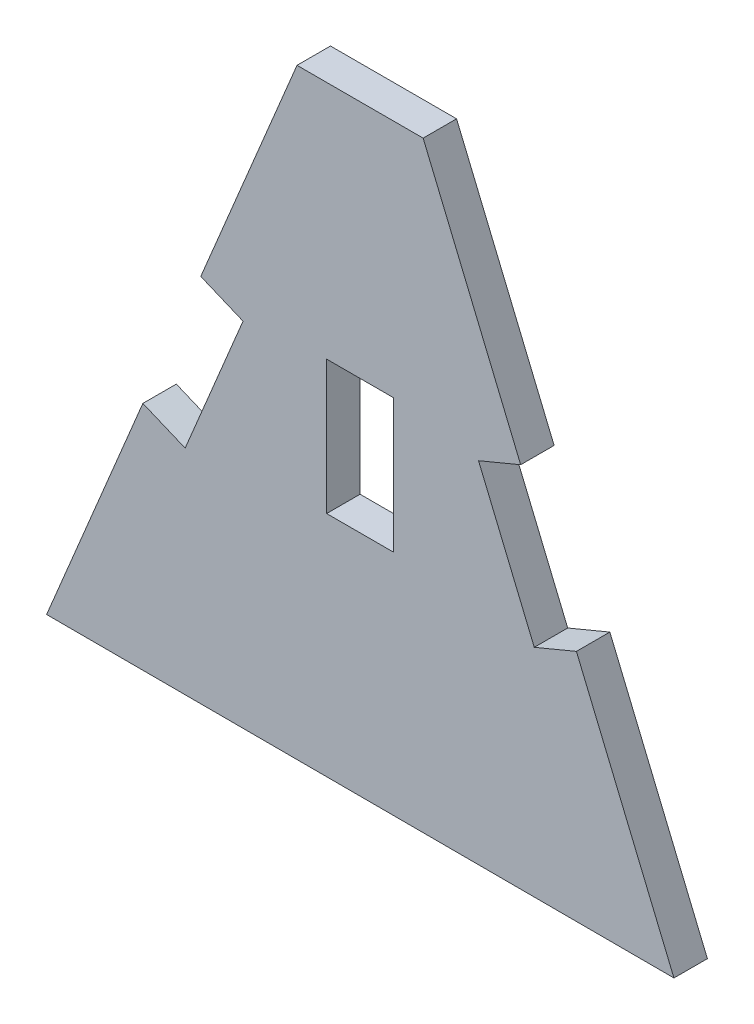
ISO-10303-21;
HEADER;
FILE_DESCRIPTION(('STEP AP214'),'2;1');
FILE_NAME('part.step','',(''),(''),'','','');
FILE_SCHEMA(('AUTOMOTIVE_DESIGN { 1 0 10303 214 1 1 1 1 }'));
ENDSEC;
DATA;
#1=APPLICATION_CONTEXT('core data for automotive mechanical design processes');
#2=APPLICATION_PROTOCOL_DEFINITION('international standard','automotive_design',2000,#1);
#3=PRODUCT_CONTEXT('',#1,'mechanical');
#4=PRODUCT('Part','Part','',(#3));
#5=PRODUCT_RELATED_PRODUCT_CATEGORY('part','',(#4));
#6=PRODUCT_DEFINITION_FORMATION('','',#4);
#7=PRODUCT_DEFINITION_CONTEXT('part definition',#1,'design');
#8=PRODUCT_DEFINITION('design','',#6,#7);
#9=PRODUCT_DEFINITION_SHAPE('','',#8);
#10=(LENGTH_UNIT() NAMED_UNIT(*) SI_UNIT(.MILLI.,.METRE.));
#11=(NAMED_UNIT(*) PLANE_ANGLE_UNIT() SI_UNIT($,.RADIAN.));
#12=(NAMED_UNIT(*) SI_UNIT($,.STERADIAN.) SOLID_ANGLE_UNIT());
#13=UNCERTAINTY_MEASURE_WITH_UNIT(LENGTH_MEASURE(1.E-05),#10,'distance_accuracy_value','');
#14=(GEOMETRIC_REPRESENTATION_CONTEXT(3) GLOBAL_UNCERTAINTY_ASSIGNED_CONTEXT((#13)) GLOBAL_UNIT_ASSIGNED_CONTEXT((#10,
#11,#12)) REPRESENTATION_CONTEXT('',''));
#15=CARTESIAN_POINT('',(0.,0.,0.));
#16=DIRECTION('',(0.,0.,1.));
#17=DIRECTION('',(1.,0.,0.));
#18=AXIS2_PLACEMENT_3D('',#15,#16,#17);
#19=CARTESIAN_POINT('',(0.,0.,1.524));
#20=DIRECTION('',(0.,0.,-1.));
#21=DIRECTION('',(-1.,0.,0.));
#22=AXIS2_PLACEMENT_3D('',#19,#20,#21);
#23=PLANE('',#22);
#24=DIRECTION('',(0.999998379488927,-0.00180028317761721,0.));
#25=VECTOR('',#24,1.);
#26=CARTESIAN_POINT('',(14.2962974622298,-13.7179386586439,1.524));
#27=LINE('',#26,#25);
#28=CARTESIAN_POINT('',(-14.2962974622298,-13.6664638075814,1.524));
#29=VERTEX_POINT('',#28);
#30=CARTESIAN_POINT('',(14.2962974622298,-13.7179386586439,1.524));
#31=VERTEX_POINT('',#30);
#32=EDGE_CURVE('E183',#29,#31,#27,.T.);
#33=ORIENTED_EDGE('',*,*,#32,.T.);
#34=DIRECTION('',(-0.384618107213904,0.923075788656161,0.));
#35=VECTOR('',#34,1.);
#36=CARTESIAN_POINT('',(9.85045119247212,-3.04799625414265,1.524));
#37=LINE('',#36,#35);
#38=CARTESIAN_POINT('',(9.85045119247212,-3.04799625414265,1.524));
#39=VERTEX_POINT('',#38);
#40=EDGE_CURVE('E186',#31,#39,#37,.T.);
#41=ORIENTED_EDGE('',*,*,#40,.T.);
#42=DIRECTION('',(-0.923075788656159,-0.38461810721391,0.));
#43=VECTOR('',#42,1.);
#44=CARTESIAN_POINT('',(9.85045119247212,-3.04799625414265,1.524));
#45=LINE('',#44,#43);
#46=CARTESIAN_POINT('',(7.92983666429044,-3.84825895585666,1.524));
#47=VERTEX_POINT('',#46);
#48=EDGE_CURVE('E189',#39,#47,#45,.T.);
#49=ORIENTED_EDGE('',*,*,#48,.T.);
#50=DIRECTION('',(-0.384618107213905,0.923075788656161,0.));
#51=VECTOR('',#50,1.);
#52=CARTESIAN_POINT('',(5.38981868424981,2.24773355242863,1.524));
#53=LINE('',#52,#51);
#54=CARTESIAN_POINT('',(5.38981868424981,2.24773355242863,1.524));
#55=VERTEX_POINT('',#54);
#56=EDGE_CURVE('E191',#47,#55,#53,.T.);
#57=ORIENTED_EDGE('',*,*,#56,.T.);
#58=DIRECTION('',(0.923075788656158,0.384618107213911,0.));
#59=VECTOR('',#58,1.);
#60=CARTESIAN_POINT('',(7.31043321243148,3.04799625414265,1.524));
#61=LINE('',#60,#59);
#62=CARTESIAN_POINT('',(7.31043321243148,3.04799625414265,1.524));
#63=VERTEX_POINT('',#62);
#64=EDGE_CURVE('E193',#55,#63,#61,.T.);
#65=ORIENTED_EDGE('',*,*,#64,.T.);
#66=DIRECTION('',(-0.384618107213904,0.923075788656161,0.));
#67=VECTOR('',#66,1.);
#68=CARTESIAN_POINT('',(2.86458694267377,13.7179386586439,1.524));
#69=LINE('',#68,#67);
#70=CARTESIAN_POINT('',(2.86458694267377,13.7179386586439,1.524));
#71=VERTEX_POINT('',#70);
#72=EDGE_CURVE('E195',#63,#71,#69,.T.);
#73=ORIENTED_EDGE('',*,*,#72,.T.);
#74=DIRECTION('',(-1.,0.,0.));
#75=VECTOR('',#74,1.);
#76=CARTESIAN_POINT('',(-2.88302096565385,13.7179386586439,1.524));
#77=LINE('',#76,#75);
#78=CARTESIAN_POINT('',(-2.88302096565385,13.7179386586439,1.524));
#79=VERTEX_POINT('',#78);
#80=EDGE_CURVE('E197',#71,#79,#77,.T.);
#81=ORIENTED_EDGE('',*,*,#80,.T.);
#82=DIRECTION('',(-0.384704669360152,-0.923039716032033,0.));
#83=VECTOR('',#82,1.);
#84=CARTESIAN_POINT('',(-7.27050690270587,3.19084061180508,1.524));
#85=LINE('',#84,#83);
#86=CARTESIAN_POINT('',(-7.27050690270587,3.19084061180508,1.524));
#87=VERTEX_POINT('',#86);
#88=EDGE_CURVE('E199',#79,#87,#85,.T.);
#89=ORIENTED_EDGE('',*,*,#88,.T.);
#90=DIRECTION('',(0.923039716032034,-0.384704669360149,0.));
#91=VECTOR('',#90,1.);
#92=CARTESIAN_POINT('',(-7.27050690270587,3.19084061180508,1.524));
#93=LINE('',#92,#91);
#94=CARTESIAN_POINT('',(-5.34386507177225,2.38785446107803,1.524));
#95=VERTEX_POINT('',#94);
#96=EDGE_CURVE('E201',#87,#95,#93,.T.);
#97=ORIENTED_EDGE('',*,*,#96,.T.);
#98=DIRECTION('',(-0.384704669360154,-0.923039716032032,0.));
#99=VECTOR('',#98,1.);
#100=CARTESIAN_POINT('',(-7.98216969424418,-3.94235191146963,1.524));
#101=LINE('',#100,#99);
#102=CARTESIAN_POINT('',(-7.98216969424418,-3.94235191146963,1.524));
#103=VERTEX_POINT('',#102);
#104=EDGE_CURVE('E203',#95,#103,#101,.T.);
#105=ORIENTED_EDGE('',*,*,#104,.T.);
#106=DIRECTION('',(-0.923039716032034,0.384704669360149,0.));
#107=VECTOR('',#106,1.);
#108=CARTESIAN_POINT('',(-9.9088115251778,-3.13936576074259,1.524));
#109=LINE('',#108,#107);
#110=CARTESIAN_POINT('',(-9.9088115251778,-3.13936576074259,1.524));
#111=VERTEX_POINT('',#110);
#112=EDGE_CURVE('E205',#103,#111,#109,.T.);
#113=ORIENTED_EDGE('',*,*,#112,.T.);
#114=DIRECTION('',(-0.384704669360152,-0.923039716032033,0.));
#115=VECTOR('',#114,1.);
#116=CARTESIAN_POINT('',(-14.2962974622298,-13.6664638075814,1.524));
#117=LINE('',#116,#115);
#118=EDGE_CURVE('E207',#111,#29,#117,.T.);
#119=ORIENTED_EDGE('',*,*,#118,.T.);
#120=EDGE_LOOP('',(#33,#41,#49,#57,#65,#73,#81,#89,#97,#105,#113,#119));
#121=FACE_BOUND('',#120,.T.);
#122=DIRECTION('',(-1.,0.,0.));
#123=VECTOR('',#122,1.);
#124=CARTESIAN_POINT('',(-1.53321701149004,2.79593865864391,1.524));
#125=LINE('',#124,#123);
#126=CARTESIAN_POINT('',(1.51478298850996,2.79593865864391,1.524));
#127=VERTEX_POINT('',#126);
#128=CARTESIAN_POINT('',(-1.53321701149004,2.79593865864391,1.524));
#129=VERTEX_POINT('',#128);
#130=EDGE_CURVE('E147',#127,#129,#125,.T.);
#131=ORIENTED_EDGE('',*,*,#130,.F.);
#132=DIRECTION('',(0.,1.,0.));
#133=VECTOR('',#132,1.);
#134=CARTESIAN_POINT('',(1.51478298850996,2.79593865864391,1.524));
#135=LINE('',#134,#133);
#136=CARTESIAN_POINT('',(1.51478298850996,-3.30006134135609,1.524));
#137=VERTEX_POINT('',#136);
#138=EDGE_CURVE('E169',#137,#127,#135,.T.);
#139=ORIENTED_EDGE('',*,*,#138,.F.);
#140=DIRECTION('',(1.,0.,0.));
#141=VECTOR('',#140,1.);
#142=CARTESIAN_POINT('',(-1.53321701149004,-3.30006134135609,1.524));
#143=LINE('',#142,#141);
#144=CARTESIAN_POINT('',(-1.53321701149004,-3.30006134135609,1.524));
#145=VERTEX_POINT('',#144);
#146=EDGE_CURVE('E167',#145,#137,#143,.T.);
#147=ORIENTED_EDGE('',*,*,#146,.F.);
#148=DIRECTION('',(0.,-1.,0.));
#149=VECTOR('',#148,1.);
#150=CARTESIAN_POINT('',(-1.53321701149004,2.79593865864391,1.524));
#151=LINE('',#150,#149);
#152=EDGE_CURVE('E155',#129,#145,#151,.T.);
#153=ORIENTED_EDGE('',*,*,#152,.F.);
#154=EDGE_LOOP('',(#131,#139,#147,#153));
#155=FACE_BOUND('',#154,.T.);
#156=ADVANCED_FACE('F34',(#121,#155),#23,.F.);
#157=CARTESIAN_POINT('',(0.,0.,0.));
#158=DIRECTION('',(0.,0.,-1.));
#159=DIRECTION('',(-1.,0.,0.));
#160=AXIS2_PLACEMENT_3D('',#157,#158,#159);
#161=PLANE('',#160);
#162=DIRECTION('',(0.999998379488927,-0.00180028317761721,0.));
#163=VECTOR('',#162,1.);
#164=CARTESIAN_POINT('',(14.2962974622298,-13.7179386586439,0.));
#165=LINE('',#164,#163);
#166=CARTESIAN_POINT('',(-14.2962974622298,-13.6664638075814,0.));
#167=VERTEX_POINT('',#166);
#168=CARTESIAN_POINT('',(14.2962974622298,-13.7179386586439,0.));
#169=VERTEX_POINT('',#168);
#170=EDGE_CURVE('E163',#167,#169,#165,.T.);
#171=ORIENTED_EDGE('',*,*,#170,.F.);
#172=DIRECTION('',(-0.384704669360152,-0.923039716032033,0.));
#173=VECTOR('',#172,1.);
#174=CARTESIAN_POINT('',(-14.2962974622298,-13.6664638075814,0.));
#175=LINE('',#174,#173);
#176=CARTESIAN_POINT('',(-9.9088115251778,-3.13936576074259,0.));
#177=VERTEX_POINT('',#176);
#178=EDGE_CURVE('E187',#177,#167,#175,.T.);
#179=ORIENTED_EDGE('',*,*,#178,.F.);
#180=DIRECTION('',(-0.923039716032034,0.384704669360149,0.));
#181=VECTOR('',#180,1.);
#182=CARTESIAN_POINT('',(-9.9088115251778,-3.13936576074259,0.));
#183=LINE('',#182,#181);
#184=CARTESIAN_POINT('',(-7.98216969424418,-3.94235191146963,0.));
#185=VERTEX_POINT('',#184);
#186=EDGE_CURVE('E230',#185,#177,#183,.T.);
#187=ORIENTED_EDGE('',*,*,#186,.F.);
#188=DIRECTION('',(-0.384704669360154,-0.923039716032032,0.));
#189=VECTOR('',#188,1.);
#190=CARTESIAN_POINT('',(-7.98216969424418,-3.94235191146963,0.));
#191=LINE('',#190,#189);
#192=CARTESIAN_POINT('',(-5.34386507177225,2.38785446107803,0.));
#193=VERTEX_POINT('',#192);
#194=EDGE_CURVE('E228',#193,#185,#191,.T.);
#195=ORIENTED_EDGE('',*,*,#194,.F.);
#196=DIRECTION('',(0.923039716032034,-0.384704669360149,0.));
#197=VECTOR('',#196,1.);
#198=CARTESIAN_POINT('',(-7.27050690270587,3.19084061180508,0.));
#199=LINE('',#198,#197);
#200=CARTESIAN_POINT('',(-7.27050690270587,3.19084061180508,0.));
#201=VERTEX_POINT('',#200);
#202=EDGE_CURVE('E226',#201,#193,#199,.T.);
#203=ORIENTED_EDGE('',*,*,#202,.F.);
#204=DIRECTION('',(-0.384704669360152,-0.923039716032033,0.));
#205=VECTOR('',#204,1.);
#206=CARTESIAN_POINT('',(-7.27050690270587,3.19084061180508,0.));
#207=LINE('',#206,#205);
#208=CARTESIAN_POINT('',(-2.88302096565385,13.7179386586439,0.));
#209=VERTEX_POINT('',#208);
#210=EDGE_CURVE('E224',#209,#201,#207,.T.);
#211=ORIENTED_EDGE('',*,*,#210,.F.);
#212=DIRECTION('',(-1.,0.,0.));
#213=VECTOR('',#212,1.);
#214=CARTESIAN_POINT('',(-2.88302096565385,13.7179386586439,0.));
#215=LINE('',#214,#213);
#216=CARTESIAN_POINT('',(2.86458694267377,13.7179386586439,0.));
#217=VERTEX_POINT('',#216);
#218=EDGE_CURVE('E222',#217,#209,#215,.T.);
#219=ORIENTED_EDGE('',*,*,#218,.F.);
#220=DIRECTION('',(-0.384618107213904,0.923075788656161,0.));
#221=VECTOR('',#220,1.);
#222=CARTESIAN_POINT('',(2.86458694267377,13.7179386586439,0.));
#223=LINE('',#222,#221);
#224=CARTESIAN_POINT('',(7.31043321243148,3.04799625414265,0.));
#225=VERTEX_POINT('',#224);
#226=EDGE_CURVE('E220',#225,#217,#223,.T.);
#227=ORIENTED_EDGE('',*,*,#226,.F.);
#228=DIRECTION('',(0.923075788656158,0.384618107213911,0.));
#229=VECTOR('',#228,1.);
#230=CARTESIAN_POINT('',(7.31043321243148,3.04799625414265,0.));
#231=LINE('',#230,#229);
#232=CARTESIAN_POINT('',(5.38981868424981,2.24773355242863,0.));
#233=VERTEX_POINT('',#232);
#234=EDGE_CURVE('E218',#233,#225,#231,.T.);
#235=ORIENTED_EDGE('',*,*,#234,.F.);
#236=DIRECTION('',(-0.384618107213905,0.923075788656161,0.));
#237=VECTOR('',#236,1.);
#238=CARTESIAN_POINT('',(5.38981868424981,2.24773355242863,0.));
#239=LINE('',#238,#237);
#240=CARTESIAN_POINT('',(7.92983666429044,-3.84825895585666,0.));
#241=VERTEX_POINT('',#240);
#242=EDGE_CURVE('E216',#241,#233,#239,.T.);
#243=ORIENTED_EDGE('',*,*,#242,.F.);
#244=DIRECTION('',(-0.923075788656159,-0.38461810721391,0.));
#245=VECTOR('',#244,1.);
#246=CARTESIAN_POINT('',(9.85045119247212,-3.04799625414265,0.));
#247=LINE('',#246,#245);
#248=CARTESIAN_POINT('',(9.85045119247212,-3.04799625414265,0.));
#249=VERTEX_POINT('',#248);
#250=EDGE_CURVE('E214',#249,#241,#247,.T.);
#251=ORIENTED_EDGE('',*,*,#250,.F.);
#252=DIRECTION('',(-0.384618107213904,0.923075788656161,0.));
#253=VECTOR('',#252,1.);
#254=CARTESIAN_POINT('',(9.85045119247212,-3.04799625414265,0.));
#255=LINE('',#254,#253);
#256=EDGE_CURVE('E212',#169,#249,#255,.T.);
#257=ORIENTED_EDGE('',*,*,#256,.F.);
#258=EDGE_LOOP('',(#171,#179,#187,#195,#203,#211,#219,#227,#235,#243,#251,#257));
#259=FACE_BOUND('',#258,.T.);
#260=DIRECTION('',(0.,1.,0.));
#261=VECTOR('',#260,1.);
#262=CARTESIAN_POINT('',(1.51478298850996,2.79593865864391,0.));
#263=LINE('',#262,#261);
#264=CARTESIAN_POINT('',(1.51478298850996,-3.30006134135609,0.));
#265=VERTEX_POINT('',#264);
#266=CARTESIAN_POINT('',(1.51478298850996,2.79593865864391,0.));
#267=VERTEX_POINT('',#266);
#268=EDGE_CURVE('E156',#265,#267,#263,.T.);
#269=ORIENTED_EDGE('',*,*,#268,.T.);
#270=DIRECTION('',(-1.,0.,0.));
#271=VECTOR('',#270,1.);
#272=CARTESIAN_POINT('',(-1.53321701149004,2.79593865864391,0.));
#273=LINE('',#272,#271);
#274=CARTESIAN_POINT('',(-1.53321701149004,2.79593865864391,0.));
#275=VERTEX_POINT('',#274);
#276=EDGE_CURVE('E57',#267,#275,#273,.T.);
#277=ORIENTED_EDGE('',*,*,#276,.T.);
#278=DIRECTION('',(0.,-1.,0.));
#279=VECTOR('',#278,1.);
#280=CARTESIAN_POINT('',(-1.53321701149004,2.79593865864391,0.));
#281=LINE('',#280,#279);
#282=CARTESIAN_POINT('',(-1.53321701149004,-3.30006134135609,0.));
#283=VERTEX_POINT('',#282);
#284=EDGE_CURVE('E162',#275,#283,#281,.T.);
#285=ORIENTED_EDGE('',*,*,#284,.T.);
#286=DIRECTION('',(1.,0.,0.));
#287=VECTOR('',#286,1.);
#288=CARTESIAN_POINT('',(-1.53321701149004,-3.30006134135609,0.));
#289=LINE('',#288,#287);
#290=EDGE_CURVE('E175',#283,#265,#289,.T.);
#291=ORIENTED_EDGE('',*,*,#290,.T.);
#292=EDGE_LOOP('',(#269,#277,#285,#291));
#293=FACE_BOUND('',#292,.T.);
#294=ADVANCED_FACE('F272',(#259,#293),#161,.T.);
#295=CARTESIAN_POINT('',(14.2962974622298,-13.7179386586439,1.524));
#296=DIRECTION('',(0.00180028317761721,0.999998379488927,0.));
#297=DIRECTION('',(-0.999998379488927,0.00180028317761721,0.));
#298=AXIS2_PLACEMENT_3D('',#295,#296,#297);
#299=PLANE('',#298);
#300=ORIENTED_EDGE('',*,*,#170,.T.);
#301=DIRECTION('',(0.,0.,-1.));
#302=VECTOR('',#301,1.);
#303=CARTESIAN_POINT('',(14.2962974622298,-13.7179386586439,1.524));
#304=LINE('',#303,#302);
#305=EDGE_CURVE('E11',#31,#169,#304,.T.);
#306=ORIENTED_EDGE('',*,*,#305,.F.);
#307=ORIENTED_EDGE('',*,*,#32,.F.);
#308=DIRECTION('',(0.,0.,-1.));
#309=VECTOR('',#308,1.);
#310=CARTESIAN_POINT('',(-14.2962974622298,-13.6664638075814,1.524));
#311=LINE('',#310,#309);
#312=EDGE_CURVE('E209',#29,#167,#311,.T.);
#313=ORIENTED_EDGE('',*,*,#312,.T.);
#314=EDGE_LOOP('',(#300,#306,#307,#313));
#315=FACE_BOUND('',#314,.T.);
#316=ADVANCED_FACE('F36',(#315),#299,.F.);
#317=CARTESIAN_POINT('',(9.85045119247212,-3.04799625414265,1.524));
#318=DIRECTION('',(-0.923075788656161,-0.384618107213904,0.));
#319=DIRECTION('',(0.384618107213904,-0.923075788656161,0.));
#320=AXIS2_PLACEMENT_3D('',#317,#318,#319);
#321=PLANE('',#320);
#322=ORIENTED_EDGE('',*,*,#256,.T.);
#323=DIRECTION('',(0.,0.,-1.));
#324=VECTOR('',#323,1.);
#325=CARTESIAN_POINT('',(9.85045119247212,-3.04799625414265,1.524));
#326=LINE('',#325,#324);
#327=EDGE_CURVE('E42',#39,#249,#326,.T.);
#328=ORIENTED_EDGE('',*,*,#327,.F.);
#329=ORIENTED_EDGE('',*,*,#40,.F.);
#330=ORIENTED_EDGE('',*,*,#305,.T.);
#331=EDGE_LOOP('',(#322,#328,#329,#330));
#332=FACE_BOUND('',#331,.T.);
#333=ADVANCED_FACE('F289',(#332),#321,.F.);
#334=CARTESIAN_POINT('',(9.85045119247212,-3.04799625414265,1.524));
#335=DIRECTION('',(0.38461810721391,-0.923075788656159,0.));
#336=DIRECTION('',(0.923075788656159,0.38461810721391,0.));
#337=AXIS2_PLACEMENT_3D('',#334,#335,#336);
#338=PLANE('',#337);
#339=ORIENTED_EDGE('',*,*,#250,.T.);
#340=DIRECTION('',(0.,0.,-1.));
#341=VECTOR('',#340,1.);
#342=CARTESIAN_POINT('',(7.92983666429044,-3.84825895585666,1.524));
#343=LINE('',#342,#341);
#344=EDGE_CURVE('E259',#47,#241,#343,.T.);
#345=ORIENTED_EDGE('',*,*,#344,.F.);
#346=ORIENTED_EDGE('',*,*,#48,.F.);
#347=ORIENTED_EDGE('',*,*,#327,.T.);
#348=EDGE_LOOP('',(#339,#345,#346,#347));
#349=FACE_BOUND('',#348,.T.);
#350=ADVANCED_FACE('F266',(#349),#338,.F.);
#351=CARTESIAN_POINT('',(5.38981868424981,2.24773355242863,1.524));
#352=DIRECTION('',(-0.923075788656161,-0.384618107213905,0.));
#353=DIRECTION('',(0.384618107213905,-0.923075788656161,0.));
#354=AXIS2_PLACEMENT_3D('',#351,#352,#353);
#355=PLANE('',#354);
#356=ORIENTED_EDGE('',*,*,#242,.T.);
#357=DIRECTION('',(0.,0.,-1.));
#358=VECTOR('',#357,1.);
#359=CARTESIAN_POINT('',(5.38981868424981,2.24773355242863,1.524));
#360=LINE('',#359,#358);
#361=EDGE_CURVE('E256',#55,#233,#360,.T.);
#362=ORIENTED_EDGE('',*,*,#361,.F.);
#363=ORIENTED_EDGE('',*,*,#56,.F.);
#364=ORIENTED_EDGE('',*,*,#344,.T.);
#365=EDGE_LOOP('',(#356,#362,#363,#364));
#366=FACE_BOUND('',#365,.T.);
#367=ADVANCED_FACE('F278',(#366),#355,.F.);
#368=CARTESIAN_POINT('',(7.31043321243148,3.04799625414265,1.524));
#369=DIRECTION('',(-0.384618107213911,0.923075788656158,0.));
#370=DIRECTION('',(-0.923075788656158,-0.384618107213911,0.));
#371=AXIS2_PLACEMENT_3D('',#368,#369,#370);
#372=PLANE('',#371);
#373=ORIENTED_EDGE('',*,*,#234,.T.);
#374=DIRECTION('',(0.,0.,-1.));
#375=VECTOR('',#374,1.);
#376=CARTESIAN_POINT('',(7.31043321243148,3.04799625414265,1.524));
#377=LINE('',#376,#375);
#378=EDGE_CURVE('E253',#63,#225,#377,.T.);
#379=ORIENTED_EDGE('',*,*,#378,.F.);
#380=ORIENTED_EDGE('',*,*,#64,.F.);
#381=ORIENTED_EDGE('',*,*,#361,.T.);
#382=EDGE_LOOP('',(#373,#379,#380,#381));
#383=FACE_BOUND('',#382,.T.);
#384=ADVANCED_FACE('F282',(#383),#372,.F.);
#385=CARTESIAN_POINT('',(2.86458694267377,13.7179386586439,1.524));
#386=DIRECTION('',(-0.923075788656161,-0.384618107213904,0.));
#387=DIRECTION('',(0.384618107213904,-0.923075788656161,0.));
#388=AXIS2_PLACEMENT_3D('',#385,#386,#387);
#389=PLANE('',#388);
#390=ORIENTED_EDGE('',*,*,#226,.T.);
#391=DIRECTION('',(0.,0.,-1.));
#392=VECTOR('',#391,1.);
#393=CARTESIAN_POINT('',(2.86458694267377,13.7179386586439,1.524));
#394=LINE('',#393,#392);
#395=EDGE_CURVE('E250',#71,#217,#394,.T.);
#396=ORIENTED_EDGE('',*,*,#395,.F.);
#397=ORIENTED_EDGE('',*,*,#72,.F.);
#398=ORIENTED_EDGE('',*,*,#378,.T.);
#399=EDGE_LOOP('',(#390,#396,#397,#398));
#400=FACE_BOUND('',#399,.T.);
#401=ADVANCED_FACE('F322',(#400),#389,.F.);
#402=CARTESIAN_POINT('',(-2.88302096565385,13.7179386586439,1.524));
#403=DIRECTION('',(0.,-1.,0.));
#404=DIRECTION('',(0.,0.,-1.));
#405=AXIS2_PLACEMENT_3D('',#402,#403,#404);
#406=PLANE('',#405);
#407=ORIENTED_EDGE('',*,*,#218,.T.);
#408=DIRECTION('',(0.,0.,-1.));
#409=VECTOR('',#408,1.);
#410=CARTESIAN_POINT('',(-2.88302096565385,13.7179386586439,1.524));
#411=LINE('',#410,#409);
#412=EDGE_CURVE('E247',#79,#209,#411,.T.);
#413=ORIENTED_EDGE('',*,*,#412,.F.);
#414=ORIENTED_EDGE('',*,*,#80,.F.);
#415=ORIENTED_EDGE('',*,*,#395,.T.);
#416=EDGE_LOOP('',(#407,#413,#414,#415));
#417=FACE_BOUND('',#416,.T.);
#418=ADVANCED_FACE('F320',(#417),#406,.F.);
#419=CARTESIAN_POINT('',(-7.27050690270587,3.19084061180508,1.524));
#420=DIRECTION('',(0.923039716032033,-0.384704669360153,0.));
#421=DIRECTION('',(0.384704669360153,0.923039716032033,0.));
#422=AXIS2_PLACEMENT_3D('',#419,#420,#421);
#423=PLANE('',#422);
#424=ORIENTED_EDGE('',*,*,#210,.T.);
#425=DIRECTION('',(0.,0.,-1.));
#426=VECTOR('',#425,1.);
#427=CARTESIAN_POINT('',(-7.27050690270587,3.19084061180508,1.524));
#428=LINE('',#427,#426);
#429=EDGE_CURVE('E244',#87,#201,#428,.T.);
#430=ORIENTED_EDGE('',*,*,#429,.F.);
#431=ORIENTED_EDGE('',*,*,#88,.F.);
#432=ORIENTED_EDGE('',*,*,#412,.T.);
#433=EDGE_LOOP('',(#424,#430,#431,#432));
#434=FACE_BOUND('',#433,.T.);
#435=ADVANCED_FACE('F316',(#434),#423,.F.);
#436=CARTESIAN_POINT('',(-7.27050690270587,3.19084061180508,1.524));
#437=DIRECTION('',(0.384704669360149,0.923039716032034,0.));
#438=DIRECTION('',(-0.923039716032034,0.384704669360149,0.));
#439=AXIS2_PLACEMENT_3D('',#436,#437,#438);
#440=PLANE('',#439);
#441=ORIENTED_EDGE('',*,*,#202,.T.);
#442=DIRECTION('',(0.,0.,-1.));
#443=VECTOR('',#442,1.);
#444=CARTESIAN_POINT('',(-5.34386507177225,2.38785446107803,1.524));
#445=LINE('',#444,#443);
#446=EDGE_CURVE('E241',#95,#193,#445,.T.);
#447=ORIENTED_EDGE('',*,*,#446,.F.);
#448=ORIENTED_EDGE('',*,*,#96,.F.);
#449=ORIENTED_EDGE('',*,*,#429,.T.);
#450=EDGE_LOOP('',(#441,#447,#448,#449));
#451=FACE_BOUND('',#450,.T.);
#452=ADVANCED_FACE('F311',(#451),#440,.F.);
#453=CARTESIAN_POINT('',(-7.98216969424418,-3.94235191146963,1.524));
#454=DIRECTION('',(0.923039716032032,-0.384704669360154,0.));
#455=DIRECTION('',(0.384704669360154,0.923039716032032,0.));
#456=AXIS2_PLACEMENT_3D('',#453,#454,#455);
#457=PLANE('',#456);
#458=ORIENTED_EDGE('',*,*,#194,.T.);
#459=DIRECTION('',(0.,0.,-1.));
#460=VECTOR('',#459,1.);
#461=CARTESIAN_POINT('',(-7.98216969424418,-3.94235191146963,1.524));
#462=LINE('',#461,#460);
#463=EDGE_CURVE('E238',#103,#185,#462,.T.);
#464=ORIENTED_EDGE('',*,*,#463,.F.);
#465=ORIENTED_EDGE('',*,*,#104,.F.);
#466=ORIENTED_EDGE('',*,*,#446,.T.);
#467=EDGE_LOOP('',(#458,#464,#465,#466));
#468=FACE_BOUND('',#467,.T.);
#469=ADVANCED_FACE('F305',(#468),#457,.F.);
#470=CARTESIAN_POINT('',(-9.9088115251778,-3.13936576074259,1.524));
#471=DIRECTION('',(-0.384704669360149,-0.923039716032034,0.));
#472=DIRECTION('',(0.923039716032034,-0.384704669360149,0.));
#473=AXIS2_PLACEMENT_3D('',#470,#471,#472);
#474=PLANE('',#473);
#475=ORIENTED_EDGE('',*,*,#186,.T.);
#476=DIRECTION('',(0.,0.,-1.));
#477=VECTOR('',#476,1.);
#478=CARTESIAN_POINT('',(-9.9088115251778,-3.13936576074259,1.524));
#479=LINE('',#478,#477);
#480=EDGE_CURVE('E235',#111,#177,#479,.T.);
#481=ORIENTED_EDGE('',*,*,#480,.F.);
#482=ORIENTED_EDGE('',*,*,#112,.F.);
#483=ORIENTED_EDGE('',*,*,#463,.T.);
#484=EDGE_LOOP('',(#475,#481,#482,#483));
#485=FACE_BOUND('',#484,.T.);
#486=ADVANCED_FACE('F301',(#485),#474,.F.);
#487=CARTESIAN_POINT('',(-14.2962974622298,-13.6664638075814,1.524));
#488=DIRECTION('',(0.923039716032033,-0.384704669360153,0.));
#489=DIRECTION('',(0.384704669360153,0.923039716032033,0.));
#490=AXIS2_PLACEMENT_3D('',#487,#488,#489);
#491=PLANE('',#490);
#492=ORIENTED_EDGE('',*,*,#178,.T.);
#493=ORIENTED_EDGE('',*,*,#312,.F.);
#494=ORIENTED_EDGE('',*,*,#118,.F.);
#495=ORIENTED_EDGE('',*,*,#480,.T.);
#496=EDGE_LOOP('',(#492,#493,#494,#495));
#497=FACE_BOUND('',#496,.T.);
#498=ADVANCED_FACE('F296',(#497),#491,.F.);
#499=CARTESIAN_POINT('',(-1.53321701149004,2.79593865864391,1.524));
#500=DIRECTION('',(0.,-1.,0.));
#501=DIRECTION('',(0.,0.,-1.));
#502=AXIS2_PLACEMENT_3D('',#499,#500,#501);
#503=PLANE('',#502);
#504=ORIENTED_EDGE('',*,*,#276,.F.);
#505=DIRECTION('',(0.,0.,-1.));
#506=VECTOR('',#505,1.);
#507=CARTESIAN_POINT('',(1.51478298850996,2.79593865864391,1.524));
#508=LINE('',#507,#506);
#509=EDGE_CURVE('E151',#127,#267,#508,.T.);
#510=ORIENTED_EDGE('',*,*,#509,.F.);
#511=ORIENTED_EDGE('',*,*,#130,.T.);
#512=DIRECTION('',(0.,0.,-1.));
#513=VECTOR('',#512,1.);
#514=CARTESIAN_POINT('',(-1.53321701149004,2.79593865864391,1.524));
#515=LINE('',#514,#513);
#516=EDGE_CURVE('E150',#129,#275,#515,.T.);
#517=ORIENTED_EDGE('',*,*,#516,.T.);
#518=EDGE_LOOP('',(#504,#510,#511,#517));
#519=FACE_BOUND('',#518,.T.);
#520=ADVANCED_FACE('F149',(#519),#503,.T.);
#521=CARTESIAN_POINT('',(-1.53321701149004,2.79593865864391,1.524));
#522=DIRECTION('',(1.,0.,0.));
#523=DIRECTION('',(0.,0.,-1.));
#524=AXIS2_PLACEMENT_3D('',#521,#522,#523);
#525=PLANE('',#524);
#526=ORIENTED_EDGE('',*,*,#284,.F.);
#527=ORIENTED_EDGE('',*,*,#516,.F.);
#528=ORIENTED_EDGE('',*,*,#152,.T.);
#529=DIRECTION('',(0.,0.,-1.));
#530=VECTOR('',#529,1.);
#531=CARTESIAN_POINT('',(-1.53321701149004,-3.30006134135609,1.524));
#532=LINE('',#531,#530);
#533=EDGE_CURVE('E164',#145,#283,#532,.T.);
#534=ORIENTED_EDGE('',*,*,#533,.T.);
#535=EDGE_LOOP('',(#526,#527,#528,#534));
#536=FACE_BOUND('',#535,.T.);
#537=ADVANCED_FACE('F159',(#536),#525,.T.);
#538=CARTESIAN_POINT('',(-1.53321701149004,-3.30006134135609,1.524));
#539=DIRECTION('',(0.,1.,0.));
#540=DIRECTION('',(0.,0.,1.));
#541=AXIS2_PLACEMENT_3D('',#538,#539,#540);
#542=PLANE('',#541);
#543=ORIENTED_EDGE('',*,*,#290,.F.);
#544=ORIENTED_EDGE('',*,*,#533,.F.);
#545=ORIENTED_EDGE('',*,*,#146,.T.);
#546=DIRECTION('',(0.,0.,-1.));
#547=VECTOR('',#546,1.);
#548=CARTESIAN_POINT('',(1.51478298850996,-3.30006134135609,1.524));
#549=LINE('',#548,#547);
#550=EDGE_CURVE('E49',#137,#265,#549,.T.);
#551=ORIENTED_EDGE('',*,*,#550,.T.);
#552=EDGE_LOOP('',(#543,#544,#545,#551));
#553=FACE_BOUND('',#552,.T.);
#554=ADVANCED_FACE('F380',(#553),#542,.T.);
#555=CARTESIAN_POINT('',(1.51478298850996,2.79593865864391,1.524));
#556=DIRECTION('',(-1.,0.,0.));
#557=DIRECTION('',(0.,0.,1.));
#558=AXIS2_PLACEMENT_3D('',#555,#556,#557);
#559=PLANE('',#558);
#560=ORIENTED_EDGE('',*,*,#268,.F.);
#561=ORIENTED_EDGE('',*,*,#550,.F.);
#562=ORIENTED_EDGE('',*,*,#138,.T.);
#563=ORIENTED_EDGE('',*,*,#509,.T.);
#564=EDGE_LOOP('',(#560,#561,#562,#563));
#565=FACE_BOUND('',#564,.T.);
#566=ADVANCED_FACE('F386',(#565),#559,.T.);
#567=CLOSED_SHELL('',(#156,#294,#316,#333,#350,#367,#384,#401,#418,#435,#452,#469,#486,#498,
#520,#537,#554,#566));
#568=MANIFOLD_SOLID_BREP('B2',#567);
#569=ADVANCED_BREP_SHAPE_REPRESENTATION('',(#18,#568),#14);
#570=SHAPE_DEFINITION_REPRESENTATION(#9,#569);
ENDSEC;
END-ISO-10303-21;
